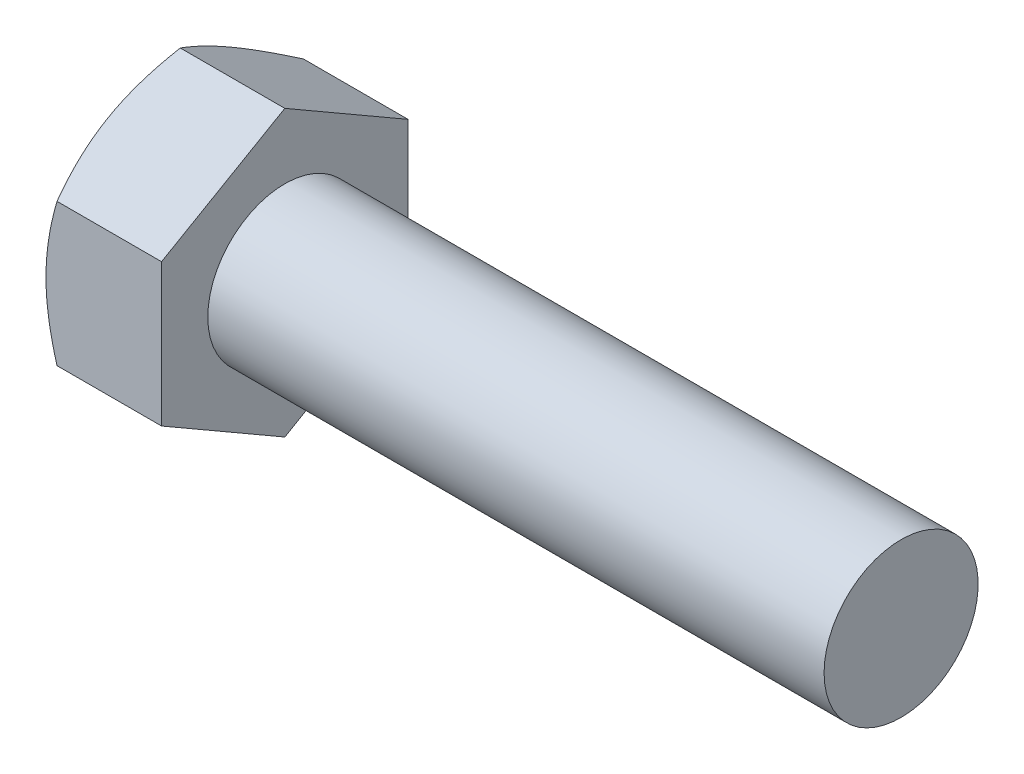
from build123d import *

# Parameters (mm, degrees)
SKETCH2_R     = 9.330254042
HEX_DIE_DEPTH = 7.5
SKETCH4_R     = 7
INDENT_DEPTH  = 0.9375


with BuildPart() as part:
    # BodySke → Base-Revolve (revolve)
    with BuildSketch(Plane.XY, mode=Mode.PRIVATE) as base_revolve_sk:
        Polygon((7.5, 5), (7.5, 9.237875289), (0.714687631, 9.237875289), (0, 8), (0, 0), (47.5, 0), (47.5, 5), align=None)
    revolve(base_revolve_sk.sketch.rotate(Axis((-25.4, 0, 0), (1, 0, 0)), 90), axis=Axis((-25.4, 0, 0), (1, 0, 0)))

    # Sketch2 → Hex-Die (cut)
    with BuildSketch(Plane(origin=(0, 0, 0), x_dir=(0, 0, -1), z_dir=(1, 0, 0))):
        Circle(SKETCH2_R)
        Polygon((-8, 4.618802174), (0, 9.237604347), (8, 4.618802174), (8, -4.618802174), (0, -9.237604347), (-8, -4.618802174), align=None, mode=Mode.SUBTRACT)
    extrude(amount=HEX_DIE_DEPTH, mode=Mode.SUBTRACT)

    # Sketch4 → Indent (cut)
    with BuildSketch(Plane(origin=(0, 0, 0), x_dir=(0, 0, -1), z_dir=(1, 0, 0))):
        Circle(SKETCH4_R)
    extrude(amount=INDENT_DEPTH, mode=Mode.SUBTRACT)


solid = part.part
